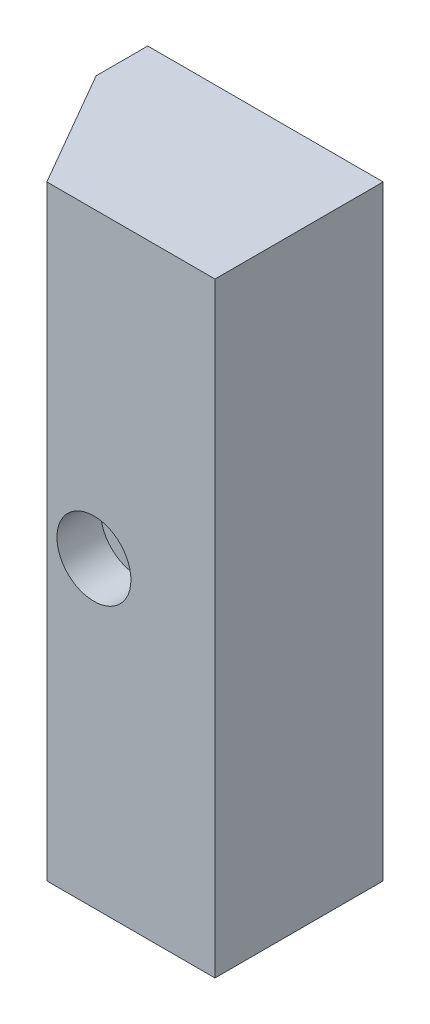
ISO-10303-21;
HEADER;
FILE_DESCRIPTION(('STEP AP214'),'2;1');
FILE_NAME('part.step','',(''),(''),'','','');
FILE_SCHEMA(('AUTOMOTIVE_DESIGN { 1 0 10303 214 1 1 1 1 }'));
ENDSEC;
DATA;
#1=APPLICATION_CONTEXT('core data for automotive mechanical design processes');
#2=APPLICATION_PROTOCOL_DEFINITION('international standard','automotive_design',2000,#1);
#3=PRODUCT_CONTEXT('',#1,'mechanical');
#4=PRODUCT('Part','Part','',(#3));
#5=PRODUCT_RELATED_PRODUCT_CATEGORY('part','',(#4));
#6=PRODUCT_DEFINITION_FORMATION('','',#4);
#7=PRODUCT_DEFINITION_CONTEXT('part definition',#1,'design');
#8=PRODUCT_DEFINITION('design','',#6,#7);
#9=PRODUCT_DEFINITION_SHAPE('','',#8);
#10=(LENGTH_UNIT() NAMED_UNIT(*) SI_UNIT(.MILLI.,.METRE.));
#11=(NAMED_UNIT(*) PLANE_ANGLE_UNIT() SI_UNIT($,.RADIAN.));
#12=(NAMED_UNIT(*) SI_UNIT($,.STERADIAN.) SOLID_ANGLE_UNIT());
#13=UNCERTAINTY_MEASURE_WITH_UNIT(LENGTH_MEASURE(1.E-05),#10,'distance_accuracy_value','');
#14=(GEOMETRIC_REPRESENTATION_CONTEXT(3) GLOBAL_UNCERTAINTY_ASSIGNED_CONTEXT((#13)) GLOBAL_UNIT_ASSIGNED_CONTEXT((#10,
#11,#12)) REPRESENTATION_CONTEXT('',''));
#15=CARTESIAN_POINT('',(0.,0.,0.));
#16=DIRECTION('',(0.,0.,1.));
#17=DIRECTION('',(1.,0.,0.));
#18=AXIS2_PLACEMENT_3D('',#15,#16,#17);
#19=CARTESIAN_POINT('',(18.,45.,25.));
#20=DIRECTION('',(0.,0.,-1.));
#21=DIRECTION('',(-1.,0.,0.));
#22=AXIS2_PLACEMENT_3D('',#19,#20,#21);
#23=PLANE('',#22);
#24=CARTESIAN_POINT('',(0.,0.,25.));
#25=DIRECTION('',(0.,0.,1.));
#26=DIRECTION('',(1.,0.,0.));
#27=AXIS2_PLACEMENT_3D('',#24,#25,#26);
#28=CIRCLE('',#27,5.5);
#29=CARTESIAN_POINT('',(5.5,0.,25.));
#30=VERTEX_POINT('',#29);
#31=EDGE_CURVE('E94',#30,#30,#28,.T.);
#32=ORIENTED_EDGE('',*,*,#31,.F.);
#33=EDGE_LOOP('',(#32));
#34=FACE_BOUND('',#33,.T.);
#35=DIRECTION('',(1.,0.,0.));
#36=VECTOR('',#35,1.);
#37=CARTESIAN_POINT('',(18.,45.,25.));
#38=LINE('',#37,#36);
#39=CARTESIAN_POINT('',(-7.,45.,25.));
#40=VERTEX_POINT('',#39);
#41=CARTESIAN_POINT('',(18.,45.,25.));
#42=VERTEX_POINT('',#41);
#43=EDGE_CURVE('E35',#40,#42,#38,.T.);
#44=ORIENTED_EDGE('',*,*,#43,.F.);
#45=DIRECTION('',(0.,-1.,0.));
#46=VECTOR('',#45,1.);
#47=CARTESIAN_POINT('',(-7.,45.,25.));
#48=LINE('',#47,#46);
#49=CARTESIAN_POINT('',(-7.,-45.,25.));
#50=VERTEX_POINT('',#49);
#51=EDGE_CURVE('E66',#40,#50,#48,.T.);
#52=ORIENTED_EDGE('',*,*,#51,.T.);
#53=DIRECTION('',(1.,0.,0.));
#54=VECTOR('',#53,1.);
#55=CARTESIAN_POINT('',(18.,-45.,25.));
#56=LINE('',#55,#54);
#57=CARTESIAN_POINT('',(18.,-45.,25.));
#58=VERTEX_POINT('',#57);
#59=EDGE_CURVE('E98',#50,#58,#56,.T.);
#60=ORIENTED_EDGE('',*,*,#59,.T.);
#61=DIRECTION('',(0.,-1.,0.));
#62=VECTOR('',#61,1.);
#63=CARTESIAN_POINT('',(18.,45.,25.));
#64=LINE('',#63,#62);
#65=EDGE_CURVE('E21',#42,#58,#64,.T.);
#66=ORIENTED_EDGE('',*,*,#65,.F.);
#67=EDGE_LOOP('',(#44,#52,#60,#66));
#68=FACE_BOUND('',#67,.T.);
#69=ADVANCED_FACE('F14',(#34,#68),#23,.F.);
#70=CARTESIAN_POINT('',(18.,45.,25.));
#71=DIRECTION('',(-1.,0.,0.));
#72=DIRECTION('',(0.,0.,1.));
#73=AXIS2_PLACEMENT_3D('',#70,#71,#72);
#74=PLANE('',#73);
#75=DIRECTION('',(0.,0.,-1.));
#76=VECTOR('',#75,1.);
#77=CARTESIAN_POINT('',(18.,-45.,25.));
#78=LINE('',#77,#76);
#79=CARTESIAN_POINT('',(18.000000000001,-45.,0.));
#80=VERTEX_POINT('',#79);
#81=EDGE_CURVE('E102',#58,#80,#78,.T.);
#82=ORIENTED_EDGE('',*,*,#81,.T.);
#83=DIRECTION('',(0.,1.,0.));
#84=VECTOR('',#83,1.);
#85=CARTESIAN_POINT('',(18.0000000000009,45.,0.));
#86=LINE('',#85,#84);
#87=CARTESIAN_POINT('',(18.000000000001,45.,0.));
#88=VERTEX_POINT('',#87);
#89=EDGE_CURVE('E88',#80,#88,#86,.T.);
#90=ORIENTED_EDGE('',*,*,#89,.T.);
#91=DIRECTION('',(0.,0.,-1.));
#92=VECTOR('',#91,1.);
#93=CARTESIAN_POINT('',(18.,45.,25.));
#94=LINE('',#93,#92);
#95=EDGE_CURVE('E106',#42,#88,#94,.T.);
#96=ORIENTED_EDGE('',*,*,#95,.F.);
#97=ORIENTED_EDGE('',*,*,#65,.T.);
#98=EDGE_LOOP('',(#82,#90,#96,#97));
#99=FACE_BOUND('',#98,.T.);
#100=ADVANCED_FACE('F111',(#99),#74,.F.);
#101=CARTESIAN_POINT('',(-7.00043785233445,45.,25.));
#102=DIRECTION('',(0.,1.,0.));
#103=DIRECTION('',(-1.,0.,0.));
#104=AXIS2_PLACEMENT_3D('',#101,#102,#103);
#105=PLANE('',#104);
#106=DIRECTION('',(0.5,0.,0.866025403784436));
#107=VECTOR('',#106,1.);
#108=CARTESIAN_POINT('',(-7.,45.,25.));
#109=LINE('',#108,#107);
#110=CARTESIAN_POINT('',(-17.,45.,7.67949192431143));
#111=VERTEX_POINT('',#110);
#112=EDGE_CURVE('E67',#111,#40,#109,.T.);
#113=ORIENTED_EDGE('',*,*,#112,.T.);
#114=ORIENTED_EDGE('',*,*,#43,.T.);
#115=ORIENTED_EDGE('',*,*,#95,.T.);
#116=DIRECTION('',(-1.,0.,0.));
#117=VECTOR('',#116,1.);
#118=CARTESIAN_POINT('',(-26.4131318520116,45.,0.));
#119=LINE('',#118,#117);
#120=CARTESIAN_POINT('',(-17.,45.,0.));
#121=VERTEX_POINT('',#120);
#122=EDGE_CURVE('E74',#88,#121,#119,.T.);
#123=ORIENTED_EDGE('',*,*,#122,.T.);
#124=DIRECTION('',(0.,0.,1.));
#125=VECTOR('',#124,1.);
#126=CARTESIAN_POINT('',(-17.,45.,7.67949192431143));
#127=LINE('',#126,#125);
#128=EDGE_CURVE('E28',#121,#111,#127,.T.);
#129=ORIENTED_EDGE('',*,*,#128,.T.);
#130=EDGE_LOOP('',(#113,#114,#115,#123,#129));
#131=FACE_BOUND('',#130,.T.);
#132=ADVANCED_FACE('F73',(#131),#105,.T.);
#133=CARTESIAN_POINT('',(-7.00043785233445,-45.,25.));
#134=DIRECTION('',(0.,1.,0.));
#135=DIRECTION('',(-1.,0.,0.));
#136=AXIS2_PLACEMENT_3D('',#133,#134,#135);
#137=PLANE('',#136);
#138=ORIENTED_EDGE('',*,*,#59,.F.);
#139=DIRECTION('',(0.5,0.,0.866025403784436));
#140=VECTOR('',#139,1.);
#141=CARTESIAN_POINT('',(-7.,-45.,25.));
#142=LINE('',#141,#140);
#143=CARTESIAN_POINT('',(-17.,-45.,7.67949192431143));
#144=VERTEX_POINT('',#143);
#145=EDGE_CURVE('E75',#144,#50,#142,.T.);
#146=ORIENTED_EDGE('',*,*,#145,.F.);
#147=DIRECTION('',(0.,0.,1.));
#148=VECTOR('',#147,1.);
#149=CARTESIAN_POINT('',(-17.,-45.,7.67949192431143));
#150=LINE('',#149,#148);
#151=CARTESIAN_POINT('',(-17.,-45.,0.));
#152=VERTEX_POINT('',#151);
#153=EDGE_CURVE('E63',#152,#144,#150,.T.);
#154=ORIENTED_EDGE('',*,*,#153,.F.);
#155=DIRECTION('',(-1.,0.,0.));
#156=VECTOR('',#155,1.);
#157=CARTESIAN_POINT('',(-26.4131318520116,-45.,0.));
#158=LINE('',#157,#156);
#159=EDGE_CURVE('E80',#80,#152,#158,.T.);
#160=ORIENTED_EDGE('',*,*,#159,.F.);
#161=ORIENTED_EDGE('',*,*,#81,.F.);
#162=EDGE_LOOP('',(#138,#146,#154,#160,#161));
#163=FACE_BOUND('',#162,.T.);
#164=ADVANCED_FACE('F116',(#163),#137,.F.);
#165=CARTESIAN_POINT('',(0.,0.,18.5));
#166=DIRECTION('',(0.,0.,1.));
#167=DIRECTION('',(1.,0.,0.));
#168=AXIS2_PLACEMENT_3D('',#165,#166,#167);
#169=PLANE('',#168);
#170=CARTESIAN_POINT('',(0.,0.,18.5));
#171=DIRECTION('',(0.,0.,1.));
#172=DIRECTION('',(1.,0.,0.));
#173=AXIS2_PLACEMENT_3D('',#170,#171,#172);
#174=CIRCLE('',#173,3.3);
#175=CARTESIAN_POINT('',(3.3,0.,18.5));
#176=VERTEX_POINT('',#175);
#177=EDGE_CURVE('E91',#176,#176,#174,.T.);
#178=ORIENTED_EDGE('',*,*,#177,.F.);
#179=EDGE_LOOP('',(#178));
#180=FACE_BOUND('',#179,.T.);
#181=CARTESIAN_POINT('',(0.,0.,18.5));
#182=DIRECTION('',(0.,0.,1.));
#183=DIRECTION('',(1.,0.,0.));
#184=AXIS2_PLACEMENT_3D('',#181,#182,#183);
#185=CIRCLE('',#184,5.5);
#186=CARTESIAN_POINT('',(5.5,0.,18.5));
#187=VERTEX_POINT('',#186);
#188=EDGE_CURVE('E95',#187,#187,#185,.T.);
#189=ORIENTED_EDGE('',*,*,#188,.T.);
#190=EDGE_LOOP('',(#189));
#191=FACE_BOUND('',#190,.T.);
#192=ADVANCED_FACE('F143',(#180,#191),#169,.T.);
#193=CARTESIAN_POINT('',(0.,0.,18.5));
#194=DIRECTION('',(0.,0.,1.));
#195=DIRECTION('',(1.,0.,0.));
#196=AXIS2_PLACEMENT_3D('',#193,#194,#195);
#197=CYLINDRICAL_SURFACE('',#196,5.5);
#198=ORIENTED_EDGE('',*,*,#188,.F.);
#199=EDGE_LOOP('',(#198));
#200=FACE_BOUND('',#199,.T.);
#201=ORIENTED_EDGE('',*,*,#31,.T.);
#202=EDGE_LOOP('',(#201));
#203=FACE_BOUND('',#202,.T.);
#204=ADVANCED_FACE('F130',(#200,#203),#197,.F.);
#205=CARTESIAN_POINT('',(0.,0.,0.0012588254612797));
#206=DIRECTION('',(0.,0.,1.));
#207=DIRECTION('',(1.,0.,0.));
#208=AXIS2_PLACEMENT_3D('',#205,#206,#207);
#209=CYLINDRICAL_SURFACE('',#208,3.3);
#210=CARTESIAN_POINT('',(0.,0.,0.));
#211=DIRECTION('',(0.,0.,1.));
#212=DIRECTION('',(1.,0.,0.));
#213=AXIS2_PLACEMENT_3D('',#210,#211,#212);
#214=CIRCLE('',#213,3.3);
#215=CARTESIAN_POINT('',(3.3,0.,0.));
#216=VERTEX_POINT('',#215);
#217=EDGE_CURVE('E83',#216,#216,#214,.F.);
#218=ORIENTED_EDGE('',*,*,#217,.T.);
#219=EDGE_LOOP('',(#218));
#220=FACE_BOUND('',#219,.T.);
#221=ORIENTED_EDGE('',*,*,#177,.T.);
#222=EDGE_LOOP('',(#221));
#223=FACE_BOUND('',#222,.T.);
#224=ADVANCED_FACE('F120',(#220,#223),#209,.F.);
#225=CARTESIAN_POINT('',(-26.4131318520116,45.,0.));
#226=DIRECTION('',(0.,0.,1.));
#227=DIRECTION('',(1.,0.,0.));
#228=AXIS2_PLACEMENT_3D('',#225,#226,#227);
#229=PLANE('',#228);
#230=ORIENTED_EDGE('',*,*,#217,.F.);
#231=EDGE_LOOP('',(#230));
#232=FACE_BOUND('',#231,.T.);
#233=ORIENTED_EDGE('',*,*,#159,.T.);
#234=DIRECTION('',(0.,1.,0.));
#235=VECTOR('',#234,1.);
#236=CARTESIAN_POINT('',(-17.,45.,0.));
#237=LINE('',#236,#235);
#238=EDGE_CURVE('E9',#152,#121,#237,.T.);
#239=ORIENTED_EDGE('',*,*,#238,.T.);
#240=ORIENTED_EDGE('',*,*,#122,.F.);
#241=ORIENTED_EDGE('',*,*,#89,.F.);
#242=EDGE_LOOP('',(#233,#239,#240,#241));
#243=FACE_BOUND('',#242,.T.);
#244=ADVANCED_FACE('F118',(#232,#243),#229,.F.);
#245=CARTESIAN_POINT('',(-17.,45.,7.67949192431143));
#246=DIRECTION('',(1.,0.,0.));
#247=DIRECTION('',(0.,0.,-1.));
#248=AXIS2_PLACEMENT_3D('',#245,#246,#247);
#249=PLANE('',#248);
#250=ORIENTED_EDGE('',*,*,#153,.T.);
#251=DIRECTION('',(0.,-1.,0.));
#252=VECTOR('',#251,1.);
#253=CARTESIAN_POINT('',(-17.,45.,7.67949192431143));
#254=LINE('',#253,#252);
#255=EDGE_CURVE('E59',#111,#144,#254,.T.);
#256=ORIENTED_EDGE('',*,*,#255,.F.);
#257=ORIENTED_EDGE('',*,*,#128,.F.);
#258=ORIENTED_EDGE('',*,*,#238,.F.);
#259=EDGE_LOOP('',(#250,#256,#257,#258));
#260=FACE_BOUND('',#259,.T.);
#261=ADVANCED_FACE('F61',(#260),#249,.F.);
#262=CARTESIAN_POINT('',(-7.,45.,25.));
#263=DIRECTION('',(0.866025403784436,0.,-0.5));
#264=DIRECTION('',(-0.5,0.,-0.866025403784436));
#265=AXIS2_PLACEMENT_3D('',#262,#263,#264);
#266=PLANE('',#265);
#267=ORIENTED_EDGE('',*,*,#145,.T.);
#268=ORIENTED_EDGE('',*,*,#51,.F.);
#269=ORIENTED_EDGE('',*,*,#112,.F.);
#270=ORIENTED_EDGE('',*,*,#255,.T.);
#271=EDGE_LOOP('',(#267,#268,#269,#270));
#272=FACE_BOUND('',#271,.T.);
#273=ADVANCED_FACE('F69',(#272),#266,.F.);
#274=CLOSED_SHELL('',(#69,#100,#132,#164,#192,#204,#224,#244,#261,#273));
#275=MANIFOLD_SOLID_BREP('B1',#274);
#276=ADVANCED_BREP_SHAPE_REPRESENTATION('',(#18,#275),#14);
#277=SHAPE_DEFINITION_REPRESENTATION(#9,#276);
ENDSEC;
END-ISO-10303-21;
